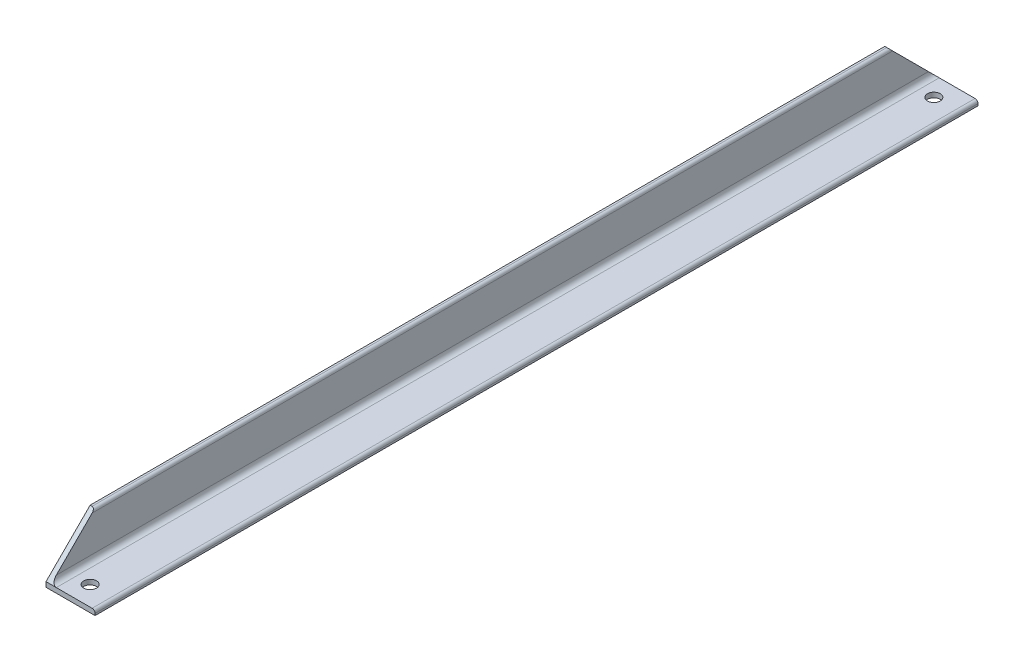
from build123d import *

# Parameters (mm, degrees)
EXTRUDE_1_DEPTH     = 450
CUT_EXTRUDE_1_DEPTH = 920
SKETCH_3_R          = 6.5
CUT_EXTRUDE_2_DEPTH = 920


with BuildPart() as part:
    # Sketch 1 → Extrude 1 (new, symmetric)
    with BuildSketch(Plane.XY):
        with BuildLine():
            Line((0, 50), (0, 0))
            Line((0, 0), (50, 0))
            Line((50, 0), (50, 2))
            ThreePointArc((50, 2), (49.121320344, 4.121320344), (47, 5))
            Line((47, 5), (10.5, 5))
            ThreePointArc((10.5, 5), (6.610912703, 6.610912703), (5, 10.5))
            Line((5, 10.5), (5, 47))
            ThreePointArc((5, 47), (4.121320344, 49.121320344), (2, 50))
            Line((2, 50), (0, 50))
        make_face()
    extrude(amount=EXTRUDE_1_DEPTH, both=True)

    # Sketch 2 → Cut-Extrude 1 (cut)
    with BuildSketch(Plane.ZY):
        Polygon((450, 50), (405, 50), (450, 5), align=None)
        Polygon((-450, 50), (-405, 50), (-450, 5), align=None)
    extrude(amount=-CUT_EXTRUDE_1_DEPTH, mode=Mode.SUBTRACT)

    # Sketch 3 → Cut-Extrude 2 (cut)
    with BuildSketch(Plane.XZ):
        with Locations(Location((25, 430, 0), (0, 0, 270))):
            Circle(SKETCH_3_R)
        with Locations(Location((25, -430, 0), (0, 0, 270))):
            Circle(SKETCH_3_R)
    extrude(amount=-CUT_EXTRUDE_2_DEPTH, mode=Mode.SUBTRACT)


solid = part.part
